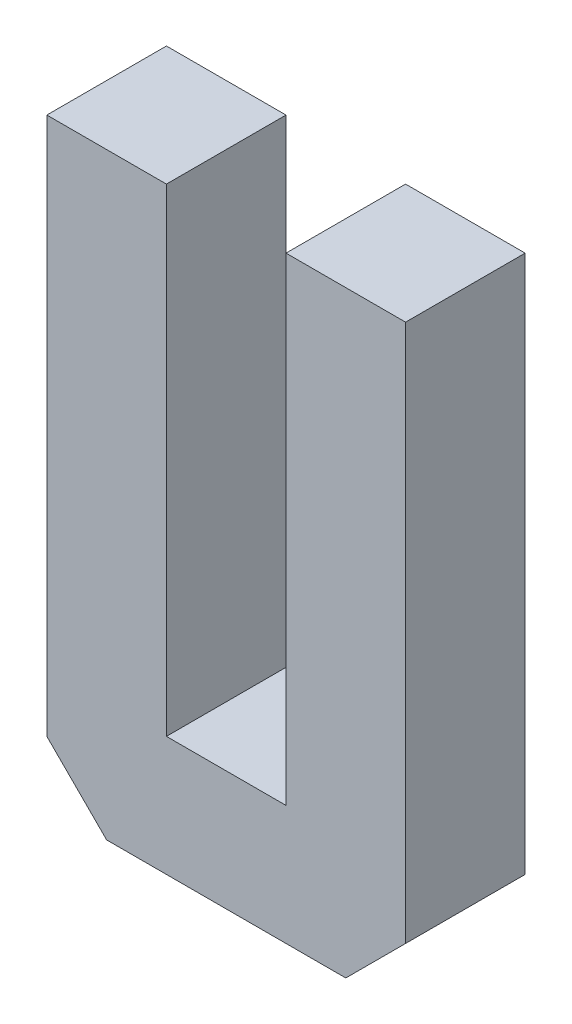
ISO-10303-21;
HEADER;
FILE_DESCRIPTION(('STEP AP214'),'2;1');
FILE_NAME('part.step','',(''),(''),'','','');
FILE_SCHEMA(('AUTOMOTIVE_DESIGN { 1 0 10303 214 1 1 1 1 }'));
ENDSEC;
DATA;
#1=APPLICATION_CONTEXT('core data for automotive mechanical design processes');
#2=APPLICATION_PROTOCOL_DEFINITION('international standard','automotive_design',2000,#1);
#3=PRODUCT_CONTEXT('',#1,'mechanical');
#4=PRODUCT('Part','Part','',(#3));
#5=PRODUCT_RELATED_PRODUCT_CATEGORY('part','',(#4));
#6=PRODUCT_DEFINITION_FORMATION('','',#4);
#7=PRODUCT_DEFINITION_CONTEXT('part definition',#1,'design');
#8=PRODUCT_DEFINITION('design','',#6,#7);
#9=PRODUCT_DEFINITION_SHAPE('','',#8);
#10=(LENGTH_UNIT() NAMED_UNIT(*) SI_UNIT(.MILLI.,.METRE.));
#11=(NAMED_UNIT(*) PLANE_ANGLE_UNIT() SI_UNIT($,.RADIAN.));
#12=(NAMED_UNIT(*) SI_UNIT($,.STERADIAN.) SOLID_ANGLE_UNIT());
#13=UNCERTAINTY_MEASURE_WITH_UNIT(LENGTH_MEASURE(1.E-05),#10,'distance_accuracy_value','');
#14=(GEOMETRIC_REPRESENTATION_CONTEXT(3) GLOBAL_UNCERTAINTY_ASSIGNED_CONTEXT((#13)) GLOBAL_UNIT_ASSIGNED_CONTEXT((#10,
#11,#12)) REPRESENTATION_CONTEXT('',''));
#15=CARTESIAN_POINT('',(0.,0.,0.));
#16=DIRECTION('',(0.,0.,1.));
#17=DIRECTION('',(1.,0.,0.));
#18=AXIS2_PLACEMENT_3D('',#15,#16,#17);
#19=CARTESIAN_POINT('',(0.,0.,10.));
#20=DIRECTION('',(1.,0.,0.));
#21=DIRECTION('',(0.,0.,-1.));
#22=AXIS2_PLACEMENT_3D('',#19,#20,#21);
#23=PLANE('',#22);
#24=DIRECTION('',(0.,-1.,0.));
#25=VECTOR('',#24,1.);
#26=CARTESIAN_POINT('',(0.,0.,0.));
#27=LINE('',#26,#25);
#28=CARTESIAN_POINT('',(0.,50.,0.));
#29=VERTEX_POINT('',#28);
#30=CARTESIAN_POINT('',(0.,5.00000000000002,0.));
#31=VERTEX_POINT('',#30);
#32=EDGE_CURVE('E148',#29,#31,#27,.T.);
#33=ORIENTED_EDGE('',*,*,#32,.T.);
#34=DIRECTION('',(0.,0.,1.));
#35=VECTOR('',#34,1.);
#36=CARTESIAN_POINT('',(0.,5.00000000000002,10.));
#37=LINE('',#36,#35);
#38=CARTESIAN_POINT('',(0.,5.00000000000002,10.));
#39=VERTEX_POINT('',#38);
#40=EDGE_CURVE('E11',#31,#39,#37,.T.);
#41=ORIENTED_EDGE('',*,*,#40,.T.);
#42=DIRECTION('',(0.,-1.,0.));
#43=VECTOR('',#42,1.);
#44=CARTESIAN_POINT('',(0.,0.,10.));
#45=LINE('',#44,#43);
#46=CARTESIAN_POINT('',(0.,50.,10.));
#47=VERTEX_POINT('',#46);
#48=EDGE_CURVE('E163',#47,#39,#45,.T.);
#49=ORIENTED_EDGE('',*,*,#48,.F.);
#50=DIRECTION('',(0.,0.,-1.));
#51=VECTOR('',#50,1.);
#52=CARTESIAN_POINT('',(0.,50.,10.));
#53=LINE('',#52,#51);
#54=EDGE_CURVE('E147',#47,#29,#53,.T.);
#55=ORIENTED_EDGE('',*,*,#54,.T.);
#56=EDGE_LOOP('',(#33,#41,#49,#55));
#57=FACE_BOUND('',#56,.T.);
#58=ADVANCED_FACE('F33',(#57),#23,.F.);
#59=CARTESIAN_POINT('',(0.,0.,10.));
#60=DIRECTION('',(0.,1.,0.));
#61=DIRECTION('',(0.,0.,1.));
#62=AXIS2_PLACEMENT_3D('',#59,#60,#61);
#63=PLANE('',#62);
#64=DIRECTION('',(1.,0.,0.));
#65=VECTOR('',#64,1.);
#66=CARTESIAN_POINT('',(0.,0.,0.));
#67=LINE('',#66,#65);
#68=CARTESIAN_POINT('',(5.,0.,0.));
#69=VERTEX_POINT('',#68);
#70=CARTESIAN_POINT('',(25.,0.,0.));
#71=VERTEX_POINT('',#70);
#72=EDGE_CURVE('E150',#69,#71,#67,.T.);
#73=ORIENTED_EDGE('',*,*,#72,.T.);
#74=DIRECTION('',(0.,0.,1.));
#75=VECTOR('',#74,1.);
#76=CARTESIAN_POINT('',(25.,0.,10.));
#77=LINE('',#76,#75);
#78=CARTESIAN_POINT('',(25.,0.,10.));
#79=VERTEX_POINT('',#78);
#80=EDGE_CURVE('E54',#71,#79,#77,.T.);
#81=ORIENTED_EDGE('',*,*,#80,.T.);
#82=DIRECTION('',(1.,0.,0.));
#83=VECTOR('',#82,1.);
#84=CARTESIAN_POINT('',(0.,0.,10.));
#85=LINE('',#84,#83);
#86=CARTESIAN_POINT('',(5.,0.,10.));
#87=VERTEX_POINT('',#86);
#88=EDGE_CURVE('E121',#87,#79,#85,.T.);
#89=ORIENTED_EDGE('',*,*,#88,.F.);
#90=DIRECTION('',(0.,0.,-1.));
#91=VECTOR('',#90,1.);
#92=CARTESIAN_POINT('',(5.,0.,10.));
#93=LINE('',#92,#91);
#94=EDGE_CURVE('E181',#87,#69,#93,.T.);
#95=ORIENTED_EDGE('',*,*,#94,.T.);
#96=EDGE_LOOP('',(#73,#81,#89,#95));
#97=FACE_BOUND('',#96,.T.);
#98=ADVANCED_FACE('F189',(#97),#63,.F.);
#99=CARTESIAN_POINT('',(30.,0.,10.));
#100=DIRECTION('',(-1.,0.,0.));
#101=DIRECTION('',(0.,0.,1.));
#102=AXIS2_PLACEMENT_3D('',#99,#100,#101);
#103=PLANE('',#102);
#104=DIRECTION('',(0.,1.,0.));
#105=VECTOR('',#104,1.);
#106=CARTESIAN_POINT('',(30.,0.,10.));
#107=LINE('',#106,#105);
#108=CARTESIAN_POINT('',(30.,5.,10.));
#109=VERTEX_POINT('',#108);
#110=CARTESIAN_POINT('',(30.,50.,10.));
#111=VERTEX_POINT('',#110);
#112=EDGE_CURVE('E111',#109,#111,#107,.T.);
#113=ORIENTED_EDGE('',*,*,#112,.F.);
#114=DIRECTION('',(0.,0.,-1.));
#115=VECTOR('',#114,1.);
#116=CARTESIAN_POINT('',(30.,5.,10.));
#117=LINE('',#116,#115);
#118=CARTESIAN_POINT('',(30.,5.,0.));
#119=VERTEX_POINT('',#118);
#120=EDGE_CURVE('E130',#109,#119,#117,.T.);
#121=ORIENTED_EDGE('',*,*,#120,.T.);
#122=DIRECTION('',(0.,1.,0.));
#123=VECTOR('',#122,1.);
#124=CARTESIAN_POINT('',(30.,0.,0.));
#125=LINE('',#124,#123);
#126=CARTESIAN_POINT('',(30.,50.,0.));
#127=VERTEX_POINT('',#126);
#128=EDGE_CURVE('E127',#119,#127,#125,.T.);
#129=ORIENTED_EDGE('',*,*,#128,.T.);
#130=DIRECTION('',(0.,0.,-1.));
#131=VECTOR('',#130,1.);
#132=CARTESIAN_POINT('',(30.,50.,10.));
#133=LINE('',#132,#131);
#134=EDGE_CURVE('E124',#111,#127,#133,.T.);
#135=ORIENTED_EDGE('',*,*,#134,.F.);
#136=EDGE_LOOP('',(#113,#121,#129,#135));
#137=FACE_BOUND('',#136,.T.);
#138=ADVANCED_FACE('F125',(#137),#103,.F.);
#139=CARTESIAN_POINT('',(20.,50.,10.));
#140=DIRECTION('',(0.,-1.,0.));
#141=DIRECTION('',(0.,0.,-1.));
#142=AXIS2_PLACEMENT_3D('',#139,#140,#141);
#143=PLANE('',#142);
#144=DIRECTION('',(-1.,0.,0.));
#145=VECTOR('',#144,1.);
#146=CARTESIAN_POINT('',(20.,50.,0.));
#147=LINE('',#146,#145);
#148=CARTESIAN_POINT('',(20.,50.,0.));
#149=VERTEX_POINT('',#148);
#150=EDGE_CURVE('E153',#127,#149,#147,.T.);
#151=ORIENTED_EDGE('',*,*,#150,.T.);
#152=DIRECTION('',(0.,0.,-1.));
#153=VECTOR('',#152,1.);
#154=CARTESIAN_POINT('',(20.,50.,10.));
#155=LINE('',#154,#153);
#156=CARTESIAN_POINT('',(20.,50.,10.));
#157=VERTEX_POINT('',#156);
#158=EDGE_CURVE('E131',#157,#149,#155,.T.);
#159=ORIENTED_EDGE('',*,*,#158,.F.);
#160=DIRECTION('',(-1.,0.,0.));
#161=VECTOR('',#160,1.);
#162=CARTESIAN_POINT('',(20.,50.,10.));
#163=LINE('',#162,#161);
#164=EDGE_CURVE('E115',#111,#157,#163,.T.);
#165=ORIENTED_EDGE('',*,*,#164,.F.);
#166=ORIENTED_EDGE('',*,*,#134,.T.);
#167=EDGE_LOOP('',(#151,#159,#165,#166));
#168=FACE_BOUND('',#167,.T.);
#169=ADVANCED_FACE('F133',(#168),#143,.F.);
#170=CARTESIAN_POINT('',(20.,50.,10.));
#171=DIRECTION('',(1.,0.,0.));
#172=DIRECTION('',(0.,1.,0.));
#173=AXIS2_PLACEMENT_3D('',#170,#171,#172);
#174=PLANE('',#173);
#175=DIRECTION('',(0.,-1.,0.));
#176=VECTOR('',#175,1.);
#177=CARTESIAN_POINT('',(20.,50.,0.));
#178=LINE('',#177,#176);
#179=CARTESIAN_POINT('',(20.,10.,0.));
#180=VERTEX_POINT('',#179);
#181=EDGE_CURVE('E155',#149,#180,#178,.T.);
#182=ORIENTED_EDGE('',*,*,#181,.T.);
#183=DIRECTION('',(0.,0.,-1.));
#184=VECTOR('',#183,1.);
#185=CARTESIAN_POINT('',(20.,10.,10.));
#186=LINE('',#185,#184);
#187=CARTESIAN_POINT('',(20.,10.,10.));
#188=VERTEX_POINT('',#187);
#189=EDGE_CURVE('E172',#188,#180,#186,.T.);
#190=ORIENTED_EDGE('',*,*,#189,.F.);
#191=DIRECTION('',(0.,-1.,0.));
#192=VECTOR('',#191,1.);
#193=CARTESIAN_POINT('',(20.,50.,10.));
#194=LINE('',#193,#192);
#195=EDGE_CURVE('E136',#157,#188,#194,.T.);
#196=ORIENTED_EDGE('',*,*,#195,.F.);
#197=ORIENTED_EDGE('',*,*,#158,.T.);
#198=EDGE_LOOP('',(#182,#190,#196,#197));
#199=FACE_BOUND('',#198,.T.);
#200=ADVANCED_FACE('F212',(#199),#174,.F.);
#201=CARTESIAN_POINT('',(10.,10.,10.));
#202=DIRECTION('',(0.,-1.,0.));
#203=DIRECTION('',(0.,0.,-1.));
#204=AXIS2_PLACEMENT_3D('',#201,#202,#203);
#205=PLANE('',#204);
#206=DIRECTION('',(-1.,0.,0.));
#207=VECTOR('',#206,1.);
#208=CARTESIAN_POINT('',(10.,10.,0.));
#209=LINE('',#208,#207);
#210=CARTESIAN_POINT('',(10.,10.,0.));
#211=VERTEX_POINT('',#210);
#212=EDGE_CURVE('E157',#180,#211,#209,.T.);
#213=ORIENTED_EDGE('',*,*,#212,.T.);
#214=DIRECTION('',(0.,0.,-1.));
#215=VECTOR('',#214,1.);
#216=CARTESIAN_POINT('',(10.,10.,10.));
#217=LINE('',#216,#215);
#218=CARTESIAN_POINT('',(10.,10.,10.));
#219=VERTEX_POINT('',#218);
#220=EDGE_CURVE('E169',#219,#211,#217,.T.);
#221=ORIENTED_EDGE('',*,*,#220,.F.);
#222=DIRECTION('',(-1.,0.,0.));
#223=VECTOR('',#222,1.);
#224=CARTESIAN_POINT('',(10.,10.,10.));
#225=LINE('',#224,#223);
#226=EDGE_CURVE('E138',#188,#219,#225,.T.);
#227=ORIENTED_EDGE('',*,*,#226,.F.);
#228=ORIENTED_EDGE('',*,*,#189,.T.);
#229=EDGE_LOOP('',(#213,#221,#227,#228));
#230=FACE_BOUND('',#229,.T.);
#231=ADVANCED_FACE('F209',(#230),#205,.F.);
#232=CARTESIAN_POINT('',(10.,50.,10.));
#233=DIRECTION('',(-1.,0.,0.));
#234=DIRECTION('',(0.,-1.,0.));
#235=AXIS2_PLACEMENT_3D('',#232,#233,#234);
#236=PLANE('',#235);
#237=DIRECTION('',(0.,1.,0.));
#238=VECTOR('',#237,1.);
#239=CARTESIAN_POINT('',(10.,50.,0.));
#240=LINE('',#239,#238);
#241=CARTESIAN_POINT('',(10.,50.,0.));
#242=VERTEX_POINT('',#241);
#243=EDGE_CURVE('E159',#211,#242,#240,.T.);
#244=ORIENTED_EDGE('',*,*,#243,.T.);
#245=DIRECTION('',(0.,0.,-1.));
#246=VECTOR('',#245,1.);
#247=CARTESIAN_POINT('',(10.,50.,10.));
#248=LINE('',#247,#246);
#249=CARTESIAN_POINT('',(10.,50.,10.));
#250=VERTEX_POINT('',#249);
#251=EDGE_CURVE('E166',#250,#242,#248,.T.);
#252=ORIENTED_EDGE('',*,*,#251,.F.);
#253=DIRECTION('',(0.,1.,0.));
#254=VECTOR('',#253,1.);
#255=CARTESIAN_POINT('',(10.,50.,10.));
#256=LINE('',#255,#254);
#257=EDGE_CURVE('E143',#219,#250,#256,.T.);
#258=ORIENTED_EDGE('',*,*,#257,.F.);
#259=ORIENTED_EDGE('',*,*,#220,.T.);
#260=EDGE_LOOP('',(#244,#252,#258,#259));
#261=FACE_BOUND('',#260,.T.);
#262=ADVANCED_FACE('F204',(#261),#236,.F.);
#263=CARTESIAN_POINT('',(0.,50.,10.));
#264=DIRECTION('',(0.,-1.,0.));
#265=DIRECTION('',(0.,0.,-1.));
#266=AXIS2_PLACEMENT_3D('',#263,#264,#265);
#267=PLANE('',#266);
#268=DIRECTION('',(-1.,0.,0.));
#269=VECTOR('',#268,1.);
#270=CARTESIAN_POINT('',(0.,50.,0.));
#271=LINE('',#270,#269);
#272=EDGE_CURVE('E161',#242,#29,#271,.T.);
#273=ORIENTED_EDGE('',*,*,#272,.T.);
#274=ORIENTED_EDGE('',*,*,#54,.F.);
#275=DIRECTION('',(-1.,0.,0.));
#276=VECTOR('',#275,1.);
#277=CARTESIAN_POINT('',(0.,50.,10.));
#278=LINE('',#277,#276);
#279=EDGE_CURVE('E145',#250,#47,#278,.T.);
#280=ORIENTED_EDGE('',*,*,#279,.F.);
#281=ORIENTED_EDGE('',*,*,#251,.T.);
#282=EDGE_LOOP('',(#273,#274,#280,#281));
#283=FACE_BOUND('',#282,.T.);
#284=ADVANCED_FACE('F198',(#283),#267,.F.);
#285=CARTESIAN_POINT('',(0.,0.,10.));
#286=DIRECTION('',(0.,0.,-1.));
#287=DIRECTION('',(-1.,0.,0.));
#288=AXIS2_PLACEMENT_3D('',#285,#286,#287);
#289=PLANE('',#288);
#290=ORIENTED_EDGE('',*,*,#88,.T.);
#291=DIRECTION('',(-0.707106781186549,-0.707106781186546,0.));
#292=VECTOR('',#291,1.);
#293=CARTESIAN_POINT('',(30.,5.,10.));
#294=LINE('',#293,#292);
#295=EDGE_CURVE('E41',#79,#109,#294,.F.);
#296=ORIENTED_EDGE('',*,*,#295,.T.);
#297=ORIENTED_EDGE('',*,*,#112,.T.);
#298=ORIENTED_EDGE('',*,*,#164,.T.);
#299=ORIENTED_EDGE('',*,*,#195,.T.);
#300=ORIENTED_EDGE('',*,*,#226,.T.);
#301=ORIENTED_EDGE('',*,*,#257,.T.);
#302=ORIENTED_EDGE('',*,*,#279,.T.);
#303=ORIENTED_EDGE('',*,*,#48,.T.);
#304=DIRECTION('',(-0.707106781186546,0.707106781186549,0.));
#305=VECTOR('',#304,1.);
#306=CARTESIAN_POINT('',(5.,0.,10.));
#307=LINE('',#306,#305);
#308=EDGE_CURVE('E185',#39,#87,#307,.F.);
#309=ORIENTED_EDGE('',*,*,#308,.T.);
#310=EDGE_LOOP('',(#290,#296,#297,#298,#299,#300,#301,#302,#303,#309));
#311=FACE_BOUND('',#310,.T.);
#312=ADVANCED_FACE('F113',(#311),#289,.F.);
#313=CARTESIAN_POINT('',(0.,0.,0.));
#314=DIRECTION('',(0.,0.,-1.));
#315=DIRECTION('',(-1.,0.,0.));
#316=AXIS2_PLACEMENT_3D('',#313,#314,#315);
#317=PLANE('',#316);
#318=ORIENTED_EDGE('',*,*,#128,.F.);
#319=DIRECTION('',(0.707106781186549,0.707106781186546,0.));
#320=VECTOR('',#319,1.);
#321=CARTESIAN_POINT('',(12.4999999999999,-12.5,0.));
#322=LINE('',#321,#320);
#323=EDGE_CURVE('E179',#119,#71,#322,.F.);
#324=ORIENTED_EDGE('',*,*,#323,.T.);
#325=ORIENTED_EDGE('',*,*,#72,.F.);
#326=DIRECTION('',(0.707106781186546,-0.707106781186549,0.));
#327=VECTOR('',#326,1.);
#328=CARTESIAN_POINT('',(2.50000000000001,2.5,0.));
#329=LINE('',#328,#327);
#330=EDGE_CURVE('E177',#69,#31,#329,.F.);
#331=ORIENTED_EDGE('',*,*,#330,.T.);
#332=ORIENTED_EDGE('',*,*,#32,.F.);
#333=ORIENTED_EDGE('',*,*,#272,.F.);
#334=ORIENTED_EDGE('',*,*,#243,.F.);
#335=ORIENTED_EDGE('',*,*,#212,.F.);
#336=ORIENTED_EDGE('',*,*,#181,.F.);
#337=ORIENTED_EDGE('',*,*,#150,.F.);
#338=EDGE_LOOP('',(#318,#324,#325,#331,#332,#333,#334,#335,#336,#337));
#339=FACE_BOUND('',#338,.T.);
#340=ADVANCED_FACE('F193',(#339),#317,.T.);
#341=CARTESIAN_POINT('',(30.,5.,10.));
#342=DIRECTION('',(-0.707106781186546,0.707106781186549,0.));
#343=DIRECTION('',(0.,0.,-1.));
#344=AXIS2_PLACEMENT_3D('',#341,#342,#343);
#345=PLANE('',#344);
#346=ORIENTED_EDGE('',*,*,#295,.F.);
#347=ORIENTED_EDGE('',*,*,#80,.F.);
#348=ORIENTED_EDGE('',*,*,#323,.F.);
#349=ORIENTED_EDGE('',*,*,#120,.F.);
#350=EDGE_LOOP('',(#346,#347,#348,#349));
#351=FACE_BOUND('',#350,.T.);
#352=ADVANCED_FACE('F214',(#351),#345,.F.);
#353=CARTESIAN_POINT('',(5.,0.,10.));
#354=DIRECTION('',(0.707106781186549,0.707106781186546,0.));
#355=DIRECTION('',(0.,0.,-1.));
#356=AXIS2_PLACEMENT_3D('',#353,#354,#355);
#357=PLANE('',#356);
#358=ORIENTED_EDGE('',*,*,#308,.F.);
#359=ORIENTED_EDGE('',*,*,#40,.F.);
#360=ORIENTED_EDGE('',*,*,#330,.F.);
#361=ORIENTED_EDGE('',*,*,#94,.F.);
#362=EDGE_LOOP('',(#358,#359,#360,#361));
#363=FACE_BOUND('',#362,.T.);
#364=ADVANCED_FACE('F35',(#363),#357,.F.);
#365=CLOSED_SHELL('',(#58,#98,#138,#169,#200,#231,#262,#284,#312,#340,#352,#364));
#366=MANIFOLD_SOLID_BREP('B2',#365);
#367=ADVANCED_BREP_SHAPE_REPRESENTATION('',(#18,#366),#14);
#368=SHAPE_DEFINITION_REPRESENTATION(#9,#367);
ENDSEC;
END-ISO-10303-21;
